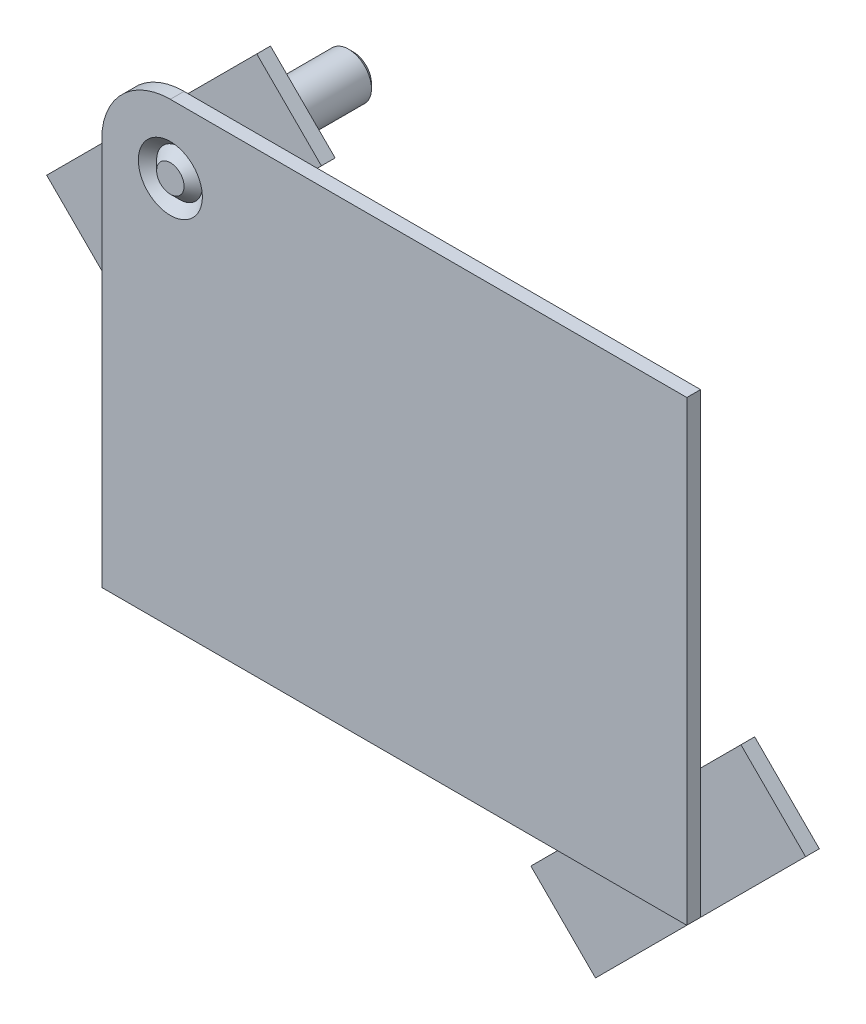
from build123d import *

# Parameters (mm, degrees)
EXTRUSION1_DEPTH        = 3
EXTRUSION2_DEPTH        = 3
EXTRUSION2_2_DEPTH      = 3
ESQUISSE3_R             = 5
ENL_V_MAT_EXTRU_1_DEPTH = 143.702146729
CHANFREIN1_SIZE         = 2
ESQUISSE5_R             = 6.5
ENL_V_MAT_EXTRU_2_DEPTH = 3


with BuildPart() as part:
    # Esquisse1 → Extrusion1 (new body)
    with BuildSketch(Plane.XY):
        with BuildLine():
            Line((-22.761542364, 36.324961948), (90.238457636, 36.324961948))
            Line((90.238457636, 36.324961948), (90.238457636, -63.675038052))
            Line((90.238457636, -63.675038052), (-37.761542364, -63.675038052))
            Line((-37.761542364, -63.675038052), (-37.761542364, 21.324961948))
            ThreePointArc((-37.761542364, 21.324961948), (-33.368144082, 31.931563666), (-22.761542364, 36.324961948))
        make_face()
    extrude(amount=EXTRUSION1_DEPTH)


with BuildPart() as body_2:
    # Esquisse2 → Extrusion2 (new body)
    with BuildSketch(Plane(origin=(0, 0, 0), x_dir=(-1, 0, 0), z_dir=(0, 0, -1))):
        Polygon((-67.257487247, -86.65600844), (-113.219428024, -40.694067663), (-99.077292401, -26.551932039), (-53.115351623, -72.513872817), align=None)
    extrude(amount=EXTRUSION2_DEPTH)


with BuildPart() as body_3:
    # Esquisse2 → Extrusion2 2 (new body)
    with BuildSketch(Plane(origin=(0, 0, 0), x_dir=(-1, 0, 0), z_dir=(0, 0, -1))):
        Polygon((-7.290495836, 37.234864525), (38.671444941, -8.727076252), (52.813580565, 5.415059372), (6.851639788, 51.377000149), align=None)
    extrude(amount=EXTRUSION2_2_DEPTH)


with BuildPart() as enl_v_mat_extru_1_tool:
    # Esquisse3 → Enl_v. mat.-Extru.1 (new, through all)
    with BuildSketch(Plane.XY.offset(3)):
        with Locations((-22.761542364, 21.324961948)):
            Circle(ESQUISSE3_R)
    extrude(amount=-ENL_V_MAT_EXTRU_1_DEPTH)


with BuildPart() as part_1:
    add(part.part)

    # Enl_v. mat.-Extru.1: cut by enl_v_mat_extru_1_tool
    add(enl_v_mat_extru_1_tool.part, mode=Mode.SUBTRACT)

    # Chanfrein1
    chanfrein1_edges = [part_1.edges().sort_by_distance(p)[0] for p in [
        (-27.761542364, 21.324961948, 3),
    ]]
    chamfer(chanfrein1_edges, length=CHANFREIN1_SIZE)


with BuildPart() as body_3_1:
    add(body_3.part)

    # Enl_v. mat.-Extru.1: cut by enl_v_mat_extru_1_tool
    add(enl_v_mat_extru_1_tool.part, mode=Mode.SUBTRACT)


with BuildPart() as body_4:
    # Esquisse4 → R_volution2 (revolve)
    with BuildSketch(Plane.ZY.offset(22.761542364), mode=Mode.PRIVATE) as r_volution2_sk:
        Polygon((-36, 26.324961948), (1, 26.324961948), (3, 24.324961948), (3, 21.964223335), (3, 21.324961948), (-37, 21.324961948), (-37, 25.324961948), align=None)
    revolve(r_volution2_sk.sketch.rotate(Axis((-22.761542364, 21.324961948, -3), (0, 0, -1)), 90), axis=Axis((-22.761542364, 21.324961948, -3), (0, 0, -1)))


with BuildPart() as enl_v_mat_extru_2_tool:
    # Esquisse5 → Enl_v. mat.-Extru.2 (new body)
    with BuildSketch(Plane(origin=(0, 0, -3), x_dir=(-1, 0, 0), z_dir=(0, 0, -1))):
        with Locations((22.761542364, 21.324961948)):
            Circle(ESQUISSE5_R)
    extrude(amount=-ENL_V_MAT_EXTRU_2_DEPTH)


with BuildPart() as body_3_2:
    add(body_3_1.part)

    # Enl_v. mat.-Extru.2: cut by enl_v_mat_extru_2_tool
    add(enl_v_mat_extru_2_tool.part, mode=Mode.SUBTRACT)


with BuildPart() as body_4_1:
    add(body_4.part)

    # Enl_v. mat.-Extru.2: cut by enl_v_mat_extru_2_tool
    add(enl_v_mat_extru_2_tool.part, mode=Mode.SUBTRACT)


solid = Compound([body_2.part, part_1.part, body_3_2.part, body_4_1.part])
